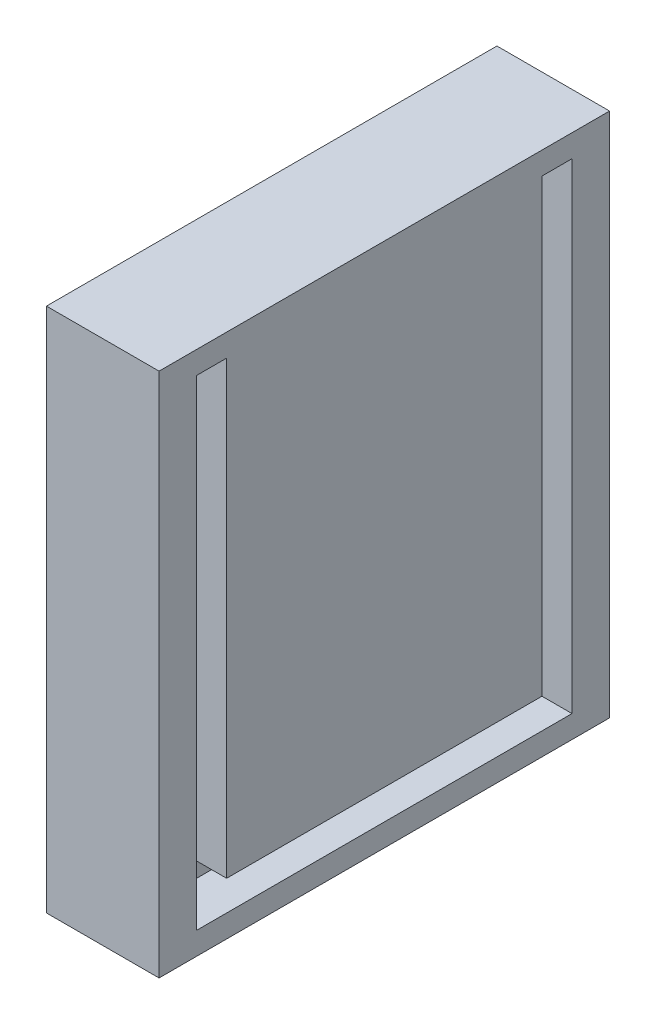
from build123d import *

# Parameters (mm, degrees)
SKETCH5_W           = 30
SKETCH5_H           = 35
BOSS_EXTRUDE5_DEPTH = 7.5
SKETCH5_4_R         = 1.5
CUT_EXTRUDE3_DEPTH  = 3
CUT_EXTRUDE4_DEPTH  = 3


with BuildPart() as part:
    # Sketch5 → Boss-Extrude5 (new body)
    with BuildSketch(Plane(origin=(0, 0, 0), x_dir=(0, 0, -1), z_dir=(1, 0, 0))):
        with Locations((15, 17.5)):
            Rectangle(SKETCH5_W, SKETCH5_H)
    extrude(amount=BOSS_EXTRUDE5_DEPTH)

    # Sketch5_4 → Cut-Extrude3 (cut)
    with BuildSketch(Plane(origin=(0, 0, 0), x_dir=(0, 0, -1), z_dir=(1, 0, 0))):
        with Locations((9.5, 8.5)):
            Circle(SKETCH5_4_R)
        with Locations((21.5, 8.5)):
            Circle(SKETCH5_4_R)
        with Locations((21.5, 28.5)):
            Circle(SKETCH5_4_R)
        with Locations((9.5, 28.5)):
            Circle(SKETCH5_4_R)
    extrude(amount=CUT_EXTRUDE3_DEPTH, mode=Mode.SUBTRACT)

    # Sketch6 → Cut-Extrude4 (cut)
    with BuildSketch(Plane(origin=(7.5, 0, 0), x_dir=(0, 0, -1), z_dir=(1, 0, 0))):
        Polygon((2.5, 33.5), (2.5, 1.5), (27.5, 1.5), (27.5, 33.5), (25.5, 33.5), (25.5, 3.5), (4.5, 3.5), (4.5, 33.5), align=None)
    extrude(amount=-CUT_EXTRUDE4_DEPTH, mode=Mode.SUBTRACT)


solid = part.part
